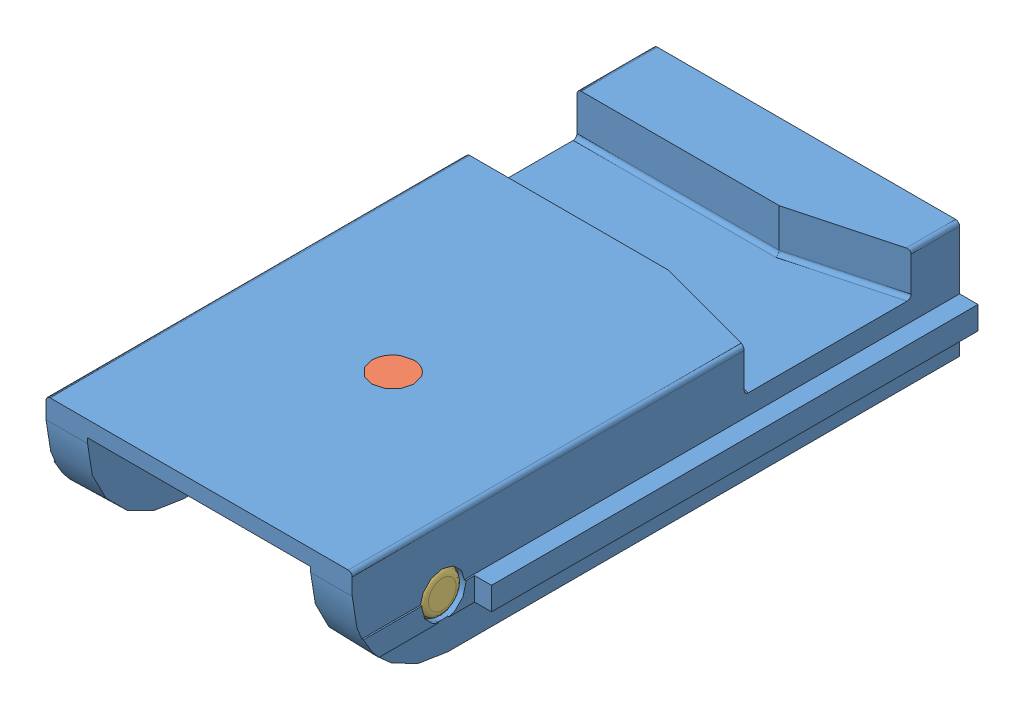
SolidWorks assembly feedbelt slide.SLDASM, configuration По умолчанию (file format 6000). Lengths in mm.
Overall size (34.14 11.61 60.45).
3 component instances, 3 part files, 4 mates.
Components (placement in the parent):
- feedbelt slide-1: feedbelt slide.SLDPRT [По умолчанию] at origin size (34.14 11.61 60.45)
- feedbelt pawl spring stud-1: feedbelt pawl spring stud.SLDPRT [По умолчанию] at (0 6.4262 41.167) x (1 0 0) z (0 -1 0) size (4.17 4.17 5.18)
- feedbelt pawl pin-1: feedbelt pawl pin.SLDPRT [По умолчанию] at (0.1905 5.2324 51.4858) x (0 0.53193 0.846788) z (-1 0 0) size (4.37 4.37 30.1)
Mates (geometry in assembly coordinates):
- Концентричный1: concentric: cylinder of feedbelt slide-1 through (0 0 41.167) axis (0 1 0) radius 1.6256; cylinder of feedbelt pawl spring stud-1 through (0 6.4262 41.167) axis (0 -1 0) radius 1.6256
- Совпадение1: coincident anti-aligned: plane of feedbelt slide-1 through (-11.0998 10.033 60.452) normal (0 -1 0); plane of feedbelt pawl spring stud-1 through (0 10.033 43.1514) normal (0 1 0)
- Концентричный2: concentric: cylinder of feedbelt slide-1 through (-17.0688 5.2324 51.4858) axis (1 0 0) radius 2.1971; cylinder of feedbelt pawl pin-1 through (-40.2328 5.2324 51.4858) axis (-1 0 0) radius 2.1844
- Совпадение2: coincident aligned: plane of feedbelt slide-1 through (15.24 5.3848 60.452) normal (1 0 0); plane of feedbelt pawl pin-1 through (15.24 5.2324 51.4858) normal (1 0 0)
